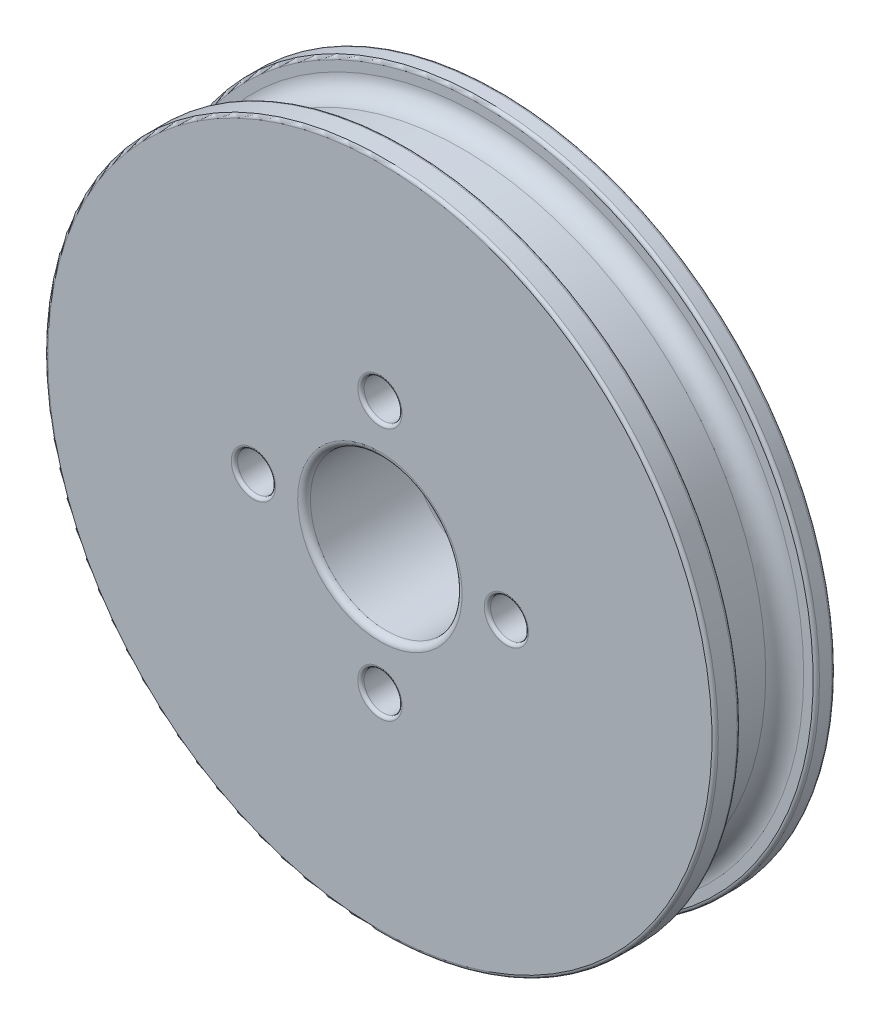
from build123d import *

# Parameters (mm, degrees)
SKETCH_2_R          = 1.5
CUT_EXTRUDE_1_DEPTH = 5
FILLET_1_R          = 0.5
FILLET_2_R          = 0.25


with BuildPart() as part:
    # Sketch 1 → Revolve 1 (revolve)
    with BuildSketch(Plane(origin=(0, 0, 0), x_dir=(0, 0, -1), z_dir=(1, 0, 0)), mode=Mode.PRIVATE) as revolve_1_sk:
        with BuildLine():
            Line((-4.5, 6), (4.5, 6))
            Line((4.5, 6), (4.5, 16))
            Line((4.5, 16), (5, 16))
            Line((5, 16), (5, 26.5))
            Line((5, 26.5), (3.5, 26.5))
            Line((3.5, 26.5), (3.5, 25.5))
            ThreePointArc((3.5, 25.5), (3.060660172, 24.439339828), (2, 24))
            Line((2, 24), (-1, 24))
            ThreePointArc((-1, 24), (-2.060660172, 24.439339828), (-2.5, 25.5))
            Line((-2.5, 25.5), (-2.5, 26.5))
            Line((-2.5, 26.5), (-4.5, 26.5))
            Line((-4.5, 26.5), (-4.5, 6))
        make_face()
    revolve(revolve_1_sk.sketch.rotate(Axis((0, 0, 4.5), (0, 0, -1)), 90), axis=Axis((0, 0, 4.5), (0, 0, -1)))

    # Sketch 2 → Cut-Extrude 1 (cut, symmetric)
    with BuildSketch(Plane.XY):
        with Locations((0, 10)):
            Circle(SKETCH_2_R)
        with Locations((10, 0)):
            Circle(SKETCH_2_R)
        with Locations((0, -10)):
            Circle(SKETCH_2_R)
        with Locations((-10, 0)):
            Circle(SKETCH_2_R)
    extrude(amount=CUT_EXTRUDE_1_DEPTH, both=True, mode=Mode.SUBTRACT)

    # Fillet 1
    fillet_1_edges = [part.edges().sort_by_distance(p)[0] for p in [
        (-6, 0, -4.5),
        (-6, 0, 4.5),
    ]]
    fillet(fillet_1_edges, radius=FILLET_1_R)

    # Fillet 2
    fillet_2_edges = [part.edges().sort_by_distance(p)[0] for p in [
        (-26.5, 0, -3.5),
        (-26.5, 0, -5),
        (-16, 0, -5),
        (-1.5, 10, -4.5),
        (-1.5, 10, 4.5),
        (8.5, 0, -4.5),
        (8.5, 0, 4.5),
        (-1.5, -10, -4.5),
        (-1.5, -10, 4.5),
        (-11.5, 0, -4.5),
        (-11.5, 0, 4.5),
        (-26.5, 0, 4.5),
        (-26.5, 0, 2.5),
    ]]
    fillet(fillet_2_edges, radius=FILLET_2_R)


solid = part.part
